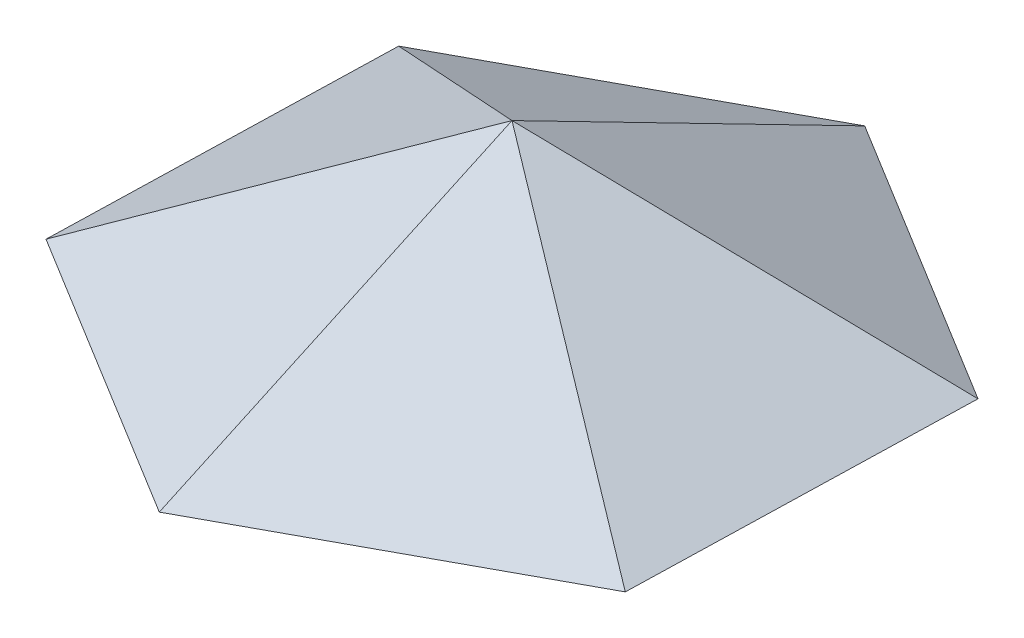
ISO-10303-21;
HEADER;
FILE_DESCRIPTION(('STEP AP214'),'2;1');
FILE_NAME('part.step','',(''),(''),'','','');
FILE_SCHEMA(('AUTOMOTIVE_DESIGN { 1 0 10303 214 1 1 1 1 }'));
ENDSEC;
DATA;
#1=APPLICATION_CONTEXT('core data for automotive mechanical design processes');
#2=APPLICATION_PROTOCOL_DEFINITION('international standard','automotive_design',2000,#1);
#3=PRODUCT_CONTEXT('',#1,'mechanical');
#4=PRODUCT('Part','Part','',(#3));
#5=PRODUCT_RELATED_PRODUCT_CATEGORY('part','',(#4));
#6=PRODUCT_DEFINITION_FORMATION('','',#4);
#7=PRODUCT_DEFINITION_CONTEXT('part definition',#1,'design');
#8=PRODUCT_DEFINITION('design','',#6,#7);
#9=PRODUCT_DEFINITION_SHAPE('','',#8);
#10=(LENGTH_UNIT() NAMED_UNIT(*) SI_UNIT(.MILLI.,.METRE.));
#11=(NAMED_UNIT(*) PLANE_ANGLE_UNIT() SI_UNIT($,.RADIAN.));
#12=(NAMED_UNIT(*) SI_UNIT($,.STERADIAN.) SOLID_ANGLE_UNIT());
#13=UNCERTAINTY_MEASURE_WITH_UNIT(LENGTH_MEASURE(1.E-05),#10,'distance_accuracy_value','');
#14=(GEOMETRIC_REPRESENTATION_CONTEXT(3) GLOBAL_UNCERTAINTY_ASSIGNED_CONTEXT((#13)) GLOBAL_UNIT_ASSIGNED_CONTEXT((#10,
#11,#12)) REPRESENTATION_CONTEXT('',''));
#15=CARTESIAN_POINT('',(0.,0.,0.));
#16=DIRECTION('',(0.,0.,1.));
#17=DIRECTION('',(1.,0.,0.));
#18=AXIS2_PLACEMENT_3D('',#15,#16,#17);
#19=CARTESIAN_POINT('',(26.3694473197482,0.,-14.3056718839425));
#20=DIRECTION('',(0.261396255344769,0.86602540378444,-0.42622998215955));
#21=DIRECTION('',(0.,0.4415831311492,0.897220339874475));
#22=AXIS2_PLACEMENT_3D('',#19,#20,#21);
#23=PLANE('',#22);
#24=DIRECTION('',(-0.852459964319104,0.,-0.52279251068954));
#25=VECTOR('',#24,1.);
#26=CARTESIAN_POINT('',(26.3694473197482,0.,-14.3056718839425));
#27=LINE('',#26,#25);
#28=CARTESIAN_POINT('',(26.3694473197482,0.,-14.3056718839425));
#29=VERTEX_POINT('',#28);
#30=CARTESIAN_POINT('',(0.795648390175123,0.,-29.9894472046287));
#31=VERTEX_POINT('',#30);
#32=EDGE_CURVE('E76',#29,#31,#27,.T.);
#33=ORIENTED_EDGE('',*,*,#32,.T.);
#34=DIRECTION('',(0.0237216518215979,-0.447213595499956,-0.894112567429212));
#35=VECTOR('',#34,1.);
#36=CARTESIAN_POINT('',(0.795648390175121,0.,-29.9894472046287));
#37=LINE('',#36,#35);
#38=CARTESIAN_POINT('',(0.,14.9999999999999,0.));
#39=VERTEX_POINT('',#38);
#40=EDGE_CURVE('E11',#39,#31,#37,.T.);
#41=ORIENTED_EDGE('',*,*,#40,.F.);
#42=DIRECTION('',(0.786185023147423,-0.447213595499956,-0.426512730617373));
#43=VECTOR('',#42,1.);
#44=CARTESIAN_POINT('',(26.3694473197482,0.,-14.3056718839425));
#45=LINE('',#44,#43);
#46=EDGE_CURVE('E55',#39,#29,#45,.T.);
#47=ORIENTED_EDGE('',*,*,#46,.T.);
#48=EDGE_LOOP('',(#33,#41,#47));
#49=FACE_BOUND('',#48,.T.);
#50=ADVANCED_FACE('F33',(#49),#23,.T.);
#51=CARTESIAN_POINT('',(0.795648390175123,0.,-29.9894472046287));
#52=DIRECTION('',(-0.238427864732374,0.86602540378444,-0.439490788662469));
#53=DIRECTION('',(0.,0.452542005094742,0.891743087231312));
#54=AXIS2_PLACEMENT_3D('',#51,#52,#53);
#55=PLANE('',#54);
#56=DIRECTION('',(-0.878981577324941,0.,0.47685572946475));
#57=VECTOR('',#56,1.);
#58=CARTESIAN_POINT('',(0.795648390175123,0.,-29.9894472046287));
#59=LINE('',#58,#57);
#60=CARTESIAN_POINT('',(-25.5737989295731,0.,-15.6837753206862));
#61=VERTEX_POINT('',#60);
#62=EDGE_CURVE('E73',#31,#61,#59,.T.);
#63=ORIENTED_EDGE('',*,*,#62,.T.);
#64=DIRECTION('',(-0.762463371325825,-0.447213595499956,-0.467599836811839));
#65=VECTOR('',#64,1.);
#66=CARTESIAN_POINT('',(-25.5737989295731,0.,-15.6837753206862));
#67=LINE('',#66,#65);
#68=EDGE_CURVE('E37',#39,#61,#67,.T.);
#69=ORIENTED_EDGE('',*,*,#68,.F.);
#70=ORIENTED_EDGE('',*,*,#40,.T.);
#71=EDGE_LOOP('',(#63,#69,#70));
#72=FACE_BOUND('',#71,.T.);
#73=ADVANCED_FACE('F35',(#72),#55,.T.);
#74=CARTESIAN_POINT('',(-25.5737989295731,0.,-15.6837753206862));
#75=DIRECTION('',(-0.499824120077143,0.86602540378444,-0.0132608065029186));
#76=DIRECTION('',(-0.866101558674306,-0.499868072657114,0.));
#77=AXIS2_PLACEMENT_3D('',#74,#75,#76);
#78=PLANE('',#77);
#79=DIRECTION('',(-0.0265216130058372,0.,0.99964824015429));
#80=VECTOR('',#79,1.);
#81=CARTESIAN_POINT('',(-25.5737989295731,0.,-15.6837753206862));
#82=LINE('',#81,#80);
#83=CARTESIAN_POINT('',(-26.3694473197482,0.,14.3056718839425));
#84=VERTEX_POINT('',#83);
#85=EDGE_CURVE('E79',#61,#84,#82,.T.);
#86=ORIENTED_EDGE('',*,*,#85,.T.);
#87=DIRECTION('',(-0.786185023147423,-0.447213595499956,0.426512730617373));
#88=VECTOR('',#87,1.);
#89=CARTESIAN_POINT('',(-26.3694473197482,0.,14.3056718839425));
#90=LINE('',#89,#88);
#91=EDGE_CURVE('E96',#39,#84,#90,.T.);
#92=ORIENTED_EDGE('',*,*,#91,.F.);
#93=ORIENTED_EDGE('',*,*,#68,.T.);
#94=EDGE_LOOP('',(#86,#92,#93));
#95=FACE_BOUND('',#94,.T.);
#96=ADVANCED_FACE('F100',(#95),#78,.T.);
#97=CARTESIAN_POINT('',(-26.3694473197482,0.,14.3056718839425));
#98=DIRECTION('',(-0.261396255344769,0.86602540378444,0.42622998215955));
#99=DIRECTION('',(0.,-0.4415831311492,0.897220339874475));
#100=AXIS2_PLACEMENT_3D('',#97,#98,#99);
#101=PLANE('',#100);
#102=DIRECTION('',(0.852459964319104,0.,0.52279251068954));
#103=VECTOR('',#102,1.);
#104=CARTESIAN_POINT('',(-26.3694473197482,0.,14.3056718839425));
#105=LINE('',#104,#103);
#106=CARTESIAN_POINT('',(-0.795648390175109,0.,29.9894472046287));
#107=VERTEX_POINT('',#106);
#108=EDGE_CURVE('E84',#84,#107,#105,.T.);
#109=ORIENTED_EDGE('',*,*,#108,.T.);
#110=DIRECTION('',(-0.0237216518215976,-0.447213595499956,0.894112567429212));
#111=VECTOR('',#110,1.);
#112=CARTESIAN_POINT('',(-0.795648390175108,0.,29.9894472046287));
#113=LINE('',#112,#111);
#114=EDGE_CURVE('E95',#39,#107,#113,.T.);
#115=ORIENTED_EDGE('',*,*,#114,.F.);
#116=ORIENTED_EDGE('',*,*,#91,.T.);
#117=EDGE_LOOP('',(#109,#115,#116));
#118=FACE_BOUND('',#117,.T.);
#119=ADVANCED_FACE('F102',(#118),#101,.T.);
#120=CARTESIAN_POINT('',(-0.795648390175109,0.,29.9894472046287));
#121=DIRECTION('',(0.238427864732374,0.86602540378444,0.439490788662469));
#122=DIRECTION('',(0.,-0.452542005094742,0.891743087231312));
#123=AXIS2_PLACEMENT_3D('',#120,#121,#122);
#124=PLANE('',#123);
#125=DIRECTION('',(0.878981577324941,0.,-0.47685572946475));
#126=VECTOR('',#125,1.);
#127=CARTESIAN_POINT('',(-0.795648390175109,0.,29.9894472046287));
#128=LINE('',#127,#126);
#129=CARTESIAN_POINT('',(25.5737989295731,0.,15.6837753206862));
#130=VERTEX_POINT('',#129);
#131=EDGE_CURVE('E87',#107,#130,#128,.T.);
#132=ORIENTED_EDGE('',*,*,#131,.T.);
#133=DIRECTION('',(0.762463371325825,-0.447213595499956,0.467599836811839));
#134=VECTOR('',#133,1.);
#135=CARTESIAN_POINT('',(25.5737989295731,0.,15.6837753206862));
#136=LINE('',#135,#134);
#137=EDGE_CURVE('E93',#39,#130,#136,.T.);
#138=ORIENTED_EDGE('',*,*,#137,.F.);
#139=ORIENTED_EDGE('',*,*,#114,.T.);
#140=EDGE_LOOP('',(#132,#138,#139));
#141=FACE_BOUND('',#140,.T.);
#142=ADVANCED_FACE('F105',(#141),#124,.T.);
#143=CARTESIAN_POINT('',(25.5737989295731,0.,15.6837753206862));
#144=DIRECTION('',(0.499824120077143,0.86602540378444,0.0132608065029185));
#145=DIRECTION('',(-0.866101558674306,0.499868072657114,0.));
#146=AXIS2_PLACEMENT_3D('',#143,#144,#145);
#147=PLANE('',#146);
#148=DIRECTION('',(0.026521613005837,0.,-0.99964824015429));
#149=VECTOR('',#148,1.);
#150=CARTESIAN_POINT('',(25.5737989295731,0.,15.6837753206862));
#151=LINE('',#150,#149);
#152=EDGE_CURVE('E90',#130,#29,#151,.T.);
#153=ORIENTED_EDGE('',*,*,#152,.T.);
#154=ORIENTED_EDGE('',*,*,#46,.F.);
#155=ORIENTED_EDGE('',*,*,#137,.T.);
#156=EDGE_LOOP('',(#153,#154,#155));
#157=FACE_BOUND('',#156,.T.);
#158=ADVANCED_FACE('F107',(#157),#147,.T.);
#159=CARTESIAN_POINT('',(0.,0.,0.));
#160=DIRECTION('',(0.,1.,0.));
#161=DIRECTION('',(0.,0.,1.));
#162=AXIS2_PLACEMENT_3D('',#159,#160,#161);
#163=PLANE('',#162);
#164=ORIENTED_EDGE('',*,*,#32,.F.);
#165=ORIENTED_EDGE('',*,*,#152,.F.);
#166=ORIENTED_EDGE('',*,*,#131,.F.);
#167=ORIENTED_EDGE('',*,*,#108,.F.);
#168=ORIENTED_EDGE('',*,*,#85,.F.);
#169=ORIENTED_EDGE('',*,*,#62,.F.);
#170=EDGE_LOOP('',(#164,#165,#166,#167,#168,#169));
#171=FACE_BOUND('',#170,.T.);
#172=ADVANCED_FACE('F74',(#171),#163,.F.);
#173=CLOSED_SHELL('',(#50,#73,#96,#119,#142,#158,#172));
#174=MANIFOLD_SOLID_BREP('B2',#173);
#175=ADVANCED_BREP_SHAPE_REPRESENTATION('',(#18,#174),#14);
#176=SHAPE_DEFINITION_REPRESENTATION(#9,#175);
ENDSEC;
END-ISO-10303-21;
